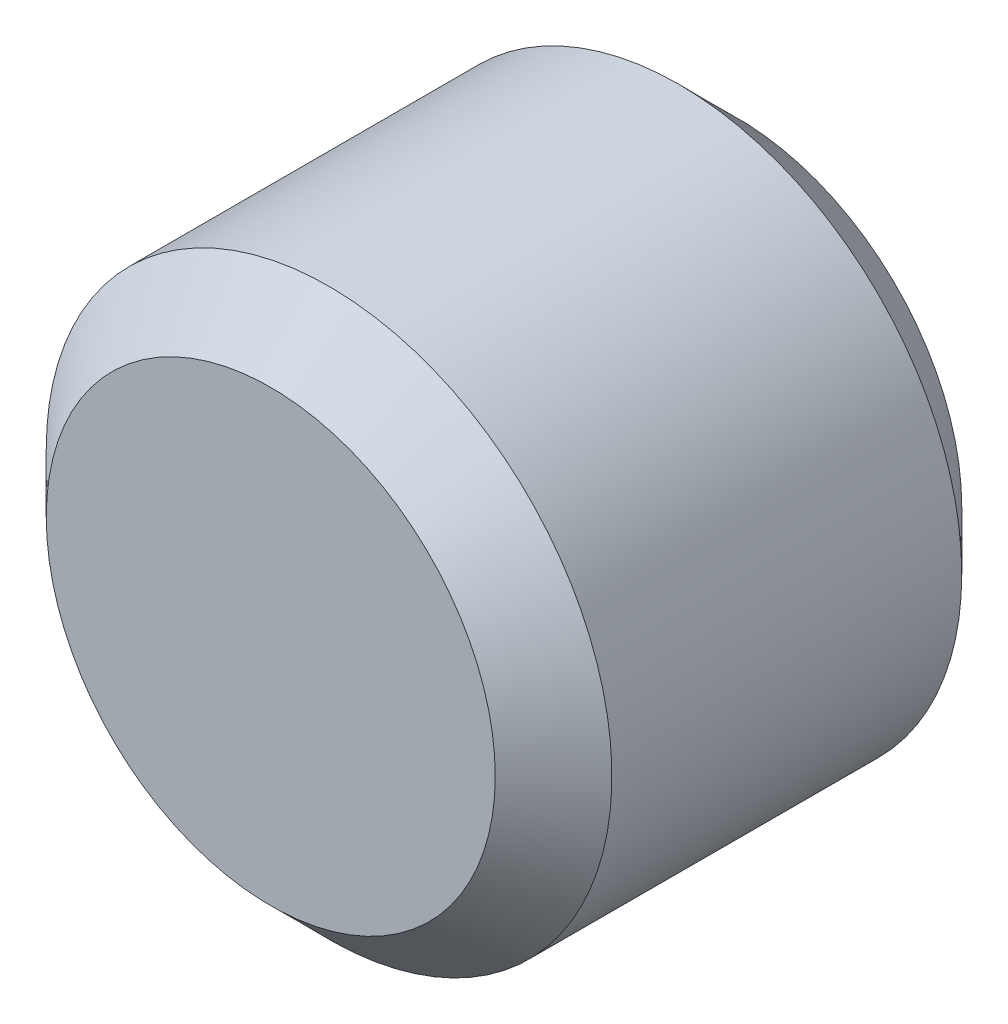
ISO-10303-21;
HEADER;
FILE_DESCRIPTION(('STEP AP214'),'2;1');
FILE_NAME('part.step','',(''),(''),'','','');
FILE_SCHEMA(('AUTOMOTIVE_DESIGN { 1 0 10303 214 1 1 1 1 }'));
ENDSEC;
DATA;
#1=APPLICATION_CONTEXT('core data for automotive mechanical design processes');
#2=APPLICATION_PROTOCOL_DEFINITION('international standard','automotive_design',2000,#1);
#3=PRODUCT_CONTEXT('',#1,'mechanical');
#4=PRODUCT('Part','Part','',(#3));
#5=PRODUCT_RELATED_PRODUCT_CATEGORY('part','',(#4));
#6=PRODUCT_DEFINITION_FORMATION('','',#4);
#7=PRODUCT_DEFINITION_CONTEXT('part definition',#1,'design');
#8=PRODUCT_DEFINITION('design','',#6,#7);
#9=PRODUCT_DEFINITION_SHAPE('','',#8);
#10=(LENGTH_UNIT() NAMED_UNIT(*) SI_UNIT(.MILLI.,.METRE.));
#11=(NAMED_UNIT(*) PLANE_ANGLE_UNIT() SI_UNIT($,.RADIAN.));
#12=(NAMED_UNIT(*) SI_UNIT($,.STERADIAN.) SOLID_ANGLE_UNIT());
#13=UNCERTAINTY_MEASURE_WITH_UNIT(LENGTH_MEASURE(1.E-05),#10,'distance_accuracy_value','');
#14=(GEOMETRIC_REPRESENTATION_CONTEXT(3) GLOBAL_UNCERTAINTY_ASSIGNED_CONTEXT((#13)) GLOBAL_UNIT_ASSIGNED_CONTEXT((#10,
#11,#12)) REPRESENTATION_CONTEXT('',''));
#15=CARTESIAN_POINT('',(0.,0.,0.));
#16=DIRECTION('',(0.,0.,1.));
#17=DIRECTION('',(1.,0.,0.));
#18=AXIS2_PLACEMENT_3D('',#15,#16,#17);
#19=CARTESIAN_POINT('',(0.,0.,7.99999999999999));
#20=DIRECTION('',(0.,0.,-1.));
#21=DIRECTION('',(-1.,0.,0.));
#22=AXIS2_PLACEMENT_3D('',#19,#20,#21);
#23=CYLINDRICAL_SURFACE('',#22,4.85);
#24=CARTESIAN_POINT('',(0.,0.,6.99999999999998));
#25=DIRECTION('',(0.,0.,1.));
#26=DIRECTION('',(1.,0.,0.));
#27=AXIS2_PLACEMENT_3D('',#24,#25,#26);
#28=CIRCLE('',#27,4.85);
#29=CARTESIAN_POINT('',(-4.84999999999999,0.,6.99999999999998));
#30=VERTEX_POINT('',#29);
#31=EDGE_CURVE('E37',#30,#30,#28,.F.);
#32=CARTESIAN_POINT('',(0.,0.,1.00000000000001));
#33=DIRECTION('',(0.,0.,1.));
#34=DIRECTION('',(1.,0.,0.));
#35=AXIS2_PLACEMENT_3D('',#32,#33,#34);
#36=CIRCLE('',#35,4.85);
#37=CARTESIAN_POINT('',(-4.84999999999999,0.,1.00000000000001));
#38=VERTEX_POINT('',#37);
#39=EDGE_CURVE('E141',#38,#38,#36,.T.);
#40=CARTESIAN_POINT('',(-4.84999999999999,0.,6.99999999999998));
#41=CARTESIAN_POINT('',(-4.84999999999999,0.,6.93749999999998));
#42=CARTESIAN_POINT('',(-4.84999999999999,0.,6.87499999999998));
#43=CARTESIAN_POINT('',(-4.84999999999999,0.,6.74999999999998));
#44=CARTESIAN_POINT('',(-4.84999999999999,0.,6.68749999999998));
#45=CARTESIAN_POINT('',(-4.84999999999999,0.,6.56249999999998));
#46=CARTESIAN_POINT('',(-4.84999999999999,0.,6.49999999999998));
#47=CARTESIAN_POINT('',(-4.84999999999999,0.,6.37499999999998));
#48=CARTESIAN_POINT('',(-4.84999999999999,0.,6.31249999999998));
#49=CARTESIAN_POINT('',(-4.84999999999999,0.,6.18749999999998));
#50=CARTESIAN_POINT('',(-4.84999999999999,0.,6.12499999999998));
#51=CARTESIAN_POINT('',(-4.84999999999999,0.,5.99999999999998));
#52=CARTESIAN_POINT('',(-4.84999999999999,0.,5.93749999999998));
#53=CARTESIAN_POINT('',(-4.84999999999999,0.,5.81249999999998));
#54=CARTESIAN_POINT('',(-4.84999999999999,0.,5.74999999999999));
#55=CARTESIAN_POINT('',(-4.84999999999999,0.,5.62499999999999));
#56=CARTESIAN_POINT('',(-4.84999999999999,0.,5.56249999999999));
#57=CARTESIAN_POINT('',(-4.84999999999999,0.,5.43749999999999));
#58=CARTESIAN_POINT('',(-4.84999999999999,0.,5.37499999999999));
#59=CARTESIAN_POINT('',(-4.84999999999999,0.,5.24999999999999));
#60=CARTESIAN_POINT('',(-4.84999999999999,0.,5.18749999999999));
#61=CARTESIAN_POINT('',(-4.84999999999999,0.,5.06249999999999));
#62=CARTESIAN_POINT('',(-4.84999999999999,0.,4.99999999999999));
#63=CARTESIAN_POINT('',(-4.84999999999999,0.,4.87499999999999));
#64=CARTESIAN_POINT('',(-4.84999999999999,0.,4.81249999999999));
#65=CARTESIAN_POINT('',(-4.84999999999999,0.,4.68749999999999));
#66=CARTESIAN_POINT('',(-4.84999999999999,0.,4.62499999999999));
#67=CARTESIAN_POINT('',(-4.84999999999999,0.,4.49999999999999));
#68=CARTESIAN_POINT('',(-4.84999999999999,0.,4.43749999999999));
#69=CARTESIAN_POINT('',(-4.84999999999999,0.,4.31249999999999));
#70=CARTESIAN_POINT('',(-4.84999999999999,0.,4.24999999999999));
#71=CARTESIAN_POINT('',(-4.84999999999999,0.,4.125));
#72=CARTESIAN_POINT('',(-4.84999999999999,0.,4.0625));
#73=CARTESIAN_POINT('',(-4.84999999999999,0.,3.9375));
#74=CARTESIAN_POINT('',(-4.84999999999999,0.,3.875));
#75=CARTESIAN_POINT('',(-4.84999999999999,0.,3.75));
#76=CARTESIAN_POINT('',(-4.84999999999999,0.,3.6875));
#77=CARTESIAN_POINT('',(-4.84999999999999,0.,3.5625));
#78=CARTESIAN_POINT('',(-4.84999999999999,0.,3.5));
#79=CARTESIAN_POINT('',(-4.84999999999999,0.,3.375));
#80=CARTESIAN_POINT('',(-4.84999999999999,0.,3.3125));
#81=CARTESIAN_POINT('',(-4.84999999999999,0.,3.1875));
#82=CARTESIAN_POINT('',(-4.84999999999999,0.,3.125));
#83=CARTESIAN_POINT('',(-4.84999999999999,0.,3.));
#84=CARTESIAN_POINT('',(-4.84999999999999,0.,2.9375));
#85=CARTESIAN_POINT('',(-4.84999999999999,0.,2.8125));
#86=CARTESIAN_POINT('',(-4.84999999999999,0.,2.75));
#87=CARTESIAN_POINT('',(-4.84999999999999,0.,2.62500000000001));
#88=CARTESIAN_POINT('',(-4.84999999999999,0.,2.56250000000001));
#89=CARTESIAN_POINT('',(-4.84999999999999,0.,2.43750000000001));
#90=CARTESIAN_POINT('',(-4.84999999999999,0.,2.37500000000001));
#91=CARTESIAN_POINT('',(-4.84999999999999,0.,2.25000000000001));
#92=CARTESIAN_POINT('',(-4.84999999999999,0.,2.18750000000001));
#93=CARTESIAN_POINT('',(-4.84999999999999,0.,2.06250000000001));
#94=CARTESIAN_POINT('',(-4.84999999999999,0.,2.00000000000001));
#95=CARTESIAN_POINT('',(-4.84999999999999,0.,1.87500000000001));
#96=CARTESIAN_POINT('',(-4.84999999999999,0.,1.81250000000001));
#97=CARTESIAN_POINT('',(-4.84999999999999,0.,1.68750000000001));
#98=CARTESIAN_POINT('',(-4.84999999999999,0.,1.62500000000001));
#99=CARTESIAN_POINT('',(-4.84999999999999,0.,1.50000000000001));
#100=CARTESIAN_POINT('',(-4.84999999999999,0.,1.43750000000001));
#101=CARTESIAN_POINT('',(-4.84999999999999,0.,1.31250000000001));
#102=CARTESIAN_POINT('',(-4.84999999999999,0.,1.25000000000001));
#103=CARTESIAN_POINT('',(-4.84999999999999,0.,1.12500000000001));
#104=CARTESIAN_POINT('',(-4.84999999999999,0.,1.06250000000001));
#105=CARTESIAN_POINT('',(-4.84999999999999,0.,1.00000000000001));
#106=B_SPLINE_CURVE_WITH_KNOTS('',3,(#40,#41,#42,#43,#44,#45,#46,#47,#48,#49,#50,#51,#52,#53,
#54,#55,#56,#57,#58,#59,#60,#61,#62,#63,#64,#65,#66,#67,#68,#69,#70,#71,#72,#73,#74,#75,#76,#77,
#78,#79,#80,#81,#82,#83,#84,#85,#86,#87,#88,#89,#90,#91,#92,#93,#94,#95,#96,#97,#98,#99,#100,
#101,#102,#103,#104,#105),.UNSPECIFIED.,.F.,.F.,(4,2,2,2,2,2,2,2,2,2,2,2,2,2,2,2,2,2,2,2,2,2,2,
2,2,2,2,2,2,2,2,2,4),(0.,0.187499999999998,0.374999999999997,0.562499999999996,
0.749999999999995,0.937499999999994,1.12499999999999,1.31249999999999,1.49999999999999,
1.68749999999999,1.87499999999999,2.06249999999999,2.24999999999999,2.43749999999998,
2.62499999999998,2.81249999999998,2.99999999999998,3.18749999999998,3.37499999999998,
3.56249999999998,3.74999999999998,3.93749999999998,4.12499999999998,4.31249999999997,
4.49999999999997,4.68749999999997,4.87499999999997,5.06249999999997,5.24999999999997,
5.43749999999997,5.62499999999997,5.81249999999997,5.99999999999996),.UNSPECIFIED.);
#107=EDGE_CURVE('BSEAM30',#30,#38,#106,.T.);
#108=ORIENTED_EDGE('',*,*,#31,.T.);
#109=ORIENTED_EDGE('',*,*,#39,.T.);
#110=ORIENTED_EDGE('',*,*,#107,.T.);
#111=ORIENTED_EDGE('',*,*,#107,.F.);
#112=EDGE_LOOP('',(#108,#110,#109,#111));
#113=FACE_BOUND('',#112,.T.);
#114=ADVANCED_FACE('F30',(#113),#23,.T.);
#115=CARTESIAN_POINT('',(0.,0.,7.99999999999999));
#116=DIRECTION('',(0.,0.,1.));
#117=DIRECTION('',(1.,0.,0.));
#118=AXIS2_PLACEMENT_3D('',#115,#116,#117);
#119=PLANE('',#118);
#120=CARTESIAN_POINT('',(0.,0.,7.99999999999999));
#121=DIRECTION('',(0.,0.,1.));
#122=DIRECTION('',(1.,0.,0.));
#123=AXIS2_PLACEMENT_3D('',#120,#121,#122);
#124=CIRCLE('',#123,3.84999999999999);
#125=CARTESIAN_POINT('',(-3.84999999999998,0.,7.99999999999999));
#126=VERTEX_POINT('',#125);
#127=EDGE_CURVE('E132',#126,#126,#124,.T.);
#128=ORIENTED_EDGE('',*,*,#127,.T.);
#129=EDGE_LOOP('',(#128));
#130=FACE_BOUND('',#129,.T.);
#131=ADVANCED_FACE('F155',(#130),#119,.T.);
#132=CARTESIAN_POINT('',(0.,0.,0.));
#133=DIRECTION('',(0.,0.,1.));
#134=DIRECTION('',(1.,0.,0.));
#135=AXIS2_PLACEMENT_3D('',#132,#133,#134);
#136=PLANE('',#135);
#137=DIRECTION('',(0.5,0.866025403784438,0.));
#138=VECTOR('',#137,1.);
#139=CARTESIAN_POINT('',(-2.8867513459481,0.,0.));
#140=LINE('',#139,#138);
#141=CARTESIAN_POINT('',(-2.8867513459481,0.,0.));
#142=VERTEX_POINT('',#141);
#143=CARTESIAN_POINT('',(-1.44337567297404,2.49999999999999,0.));
#144=VERTEX_POINT('',#143);
#145=EDGE_CURVE('E98',#142,#144,#140,.T.);
#146=ORIENTED_EDGE('',*,*,#145,.F.);
#147=DIRECTION('',(-0.499999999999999,0.866025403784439,0.));
#148=VECTOR('',#147,1.);
#149=CARTESIAN_POINT('',(-1.44337567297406,-2.5,0.));
#150=LINE('',#149,#148);
#151=CARTESIAN_POINT('',(-1.44337567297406,-2.5,0.));
#152=VERTEX_POINT('',#151);
#153=EDGE_CURVE('E44',#152,#142,#150,.T.);
#154=ORIENTED_EDGE('',*,*,#153,.F.);
#155=DIRECTION('',(-1.,0.,0.));
#156=VECTOR('',#155,1.);
#157=CARTESIAN_POINT('',(1.44337567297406,-2.5,0.));
#158=LINE('',#157,#156);
#159=CARTESIAN_POINT('',(1.44337567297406,-2.5,0.));
#160=VERTEX_POINT('',#159);
#161=EDGE_CURVE('E114',#160,#152,#158,.T.);
#162=ORIENTED_EDGE('',*,*,#161,.F.);
#163=DIRECTION('',(-0.5,-0.866025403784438,0.));
#164=VECTOR('',#163,1.);
#165=CARTESIAN_POINT('',(2.88675134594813,0.,0.));
#166=LINE('',#165,#164);
#167=CARTESIAN_POINT('',(2.88675134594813,0.,0.));
#168=VERTEX_POINT('',#167);
#169=EDGE_CURVE('E108',#168,#160,#166,.T.);
#170=ORIENTED_EDGE('',*,*,#169,.F.);
#171=DIRECTION('',(0.5,-0.866025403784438,0.));
#172=VECTOR('',#171,1.);
#173=CARTESIAN_POINT('',(1.44337567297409,2.49999999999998,0.));
#174=LINE('',#173,#172);
#175=CARTESIAN_POINT('',(1.44337567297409,2.49999999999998,0.));
#176=VERTEX_POINT('',#175);
#177=EDGE_CURVE('E106',#176,#168,#174,.T.);
#178=ORIENTED_EDGE('',*,*,#177,.F.);
#179=DIRECTION('',(1.,0.,0.));
#180=VECTOR('',#179,1.);
#181=CARTESIAN_POINT('',(-1.44337567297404,2.49999999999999,0.));
#182=LINE('',#181,#180);
#183=EDGE_CURVE('E87',#144,#176,#182,.T.);
#184=ORIENTED_EDGE('',*,*,#183,.F.);
#185=EDGE_LOOP('',(#146,#154,#162,#170,#178,#184));
#186=FACE_BOUND('',#185,.T.);
#187=CARTESIAN_POINT('',(0.,0.,0.));
#188=DIRECTION('',(0.,0.,1.));
#189=DIRECTION('',(1.,0.,0.));
#190=AXIS2_PLACEMENT_3D('',#187,#188,#189);
#191=CIRCLE('',#190,3.84999999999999);
#192=CARTESIAN_POINT('',(3.85,0.,0.));
#193=VERTEX_POINT('',#192);
#194=EDGE_CURVE('E11',#193,#193,#191,.F.);
#195=ORIENTED_EDGE('',*,*,#194,.T.);
#196=EDGE_LOOP('',(#195));
#197=FACE_BOUND('',#196,.T.);
#198=ADVANCED_FACE('F102',(#186,#197),#136,.F.);
#199=CARTESIAN_POINT('',(0.,0.,7.99999999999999));
#200=DIRECTION('',(0.,0.,-1.));
#201=DIRECTION('',(-1.,0.,0.));
#202=AXIS2_PLACEMENT_3D('',#199,#200,#201);
#203=CONICAL_SURFACE('',#202,3.84999999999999,0.785398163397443);
#204=CARTESIAN_POINT('',(-4.84999999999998,0.,6.99999999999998));
#205=CARTESIAN_POINT('',(-4.83958333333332,0.,7.01041666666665));
#206=CARTESIAN_POINT('',(-4.82916666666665,0.,7.02083333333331));
#207=CARTESIAN_POINT('',(-4.80833333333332,0.,7.04166666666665));
#208=CARTESIAN_POINT('',(-4.79791666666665,0.,7.05208333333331));
#209=CARTESIAN_POINT('',(-4.77708333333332,0.,7.07291666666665));
#210=CARTESIAN_POINT('',(-4.76666666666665,0.,7.08333333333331));
#211=CARTESIAN_POINT('',(-4.74583333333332,0.,7.10416666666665));
#212=CARTESIAN_POINT('',(-4.73541666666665,0.,7.11458333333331));
#213=CARTESIAN_POINT('',(-4.71458333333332,0.,7.13541666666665));
#214=CARTESIAN_POINT('',(-4.70416666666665,0.,7.14583333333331));
#215=CARTESIAN_POINT('',(-4.68333333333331,0.,7.16666666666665));
#216=CARTESIAN_POINT('',(-4.67291666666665,0.,7.17708333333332));
#217=CARTESIAN_POINT('',(-4.65208333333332,0.,7.19791666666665));
#218=CARTESIAN_POINT('',(-4.64166666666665,0.,7.20833333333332));
#219=CARTESIAN_POINT('',(-4.62083333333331,0.,7.22916666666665));
#220=CARTESIAN_POINT('',(-4.61041666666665,0.,7.23958333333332));
#221=CARTESIAN_POINT('',(-4.58958333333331,0.,7.26041666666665));
#222=CARTESIAN_POINT('',(-4.57916666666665,0.,7.27083333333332));
#223=CARTESIAN_POINT('',(-4.55833333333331,0.,7.29166666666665));
#224=CARTESIAN_POINT('',(-4.54791666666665,0.,7.30208333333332));
#225=CARTESIAN_POINT('',(-4.52708333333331,0.,7.32291666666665));
#226=CARTESIAN_POINT('',(-4.51666666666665,0.,7.33333333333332));
#227=CARTESIAN_POINT('',(-4.49583333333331,0.,7.35416666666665));
#228=CARTESIAN_POINT('',(-4.48541666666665,0.,7.36458333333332));
#229=CARTESIAN_POINT('',(-4.46458333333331,0.,7.38541666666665));
#230=CARTESIAN_POINT('',(-4.45416666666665,0.,7.39583333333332));
#231=CARTESIAN_POINT('',(-4.43333333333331,0.,7.41666666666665));
#232=CARTESIAN_POINT('',(-4.42291666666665,0.,7.42708333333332));
#233=CARTESIAN_POINT('',(-4.40208333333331,0.,7.44791666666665));
#234=CARTESIAN_POINT('',(-4.39166666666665,0.,7.45833333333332));
#235=CARTESIAN_POINT('',(-4.37083333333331,0.,7.47916666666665));
#236=CARTESIAN_POINT('',(-4.36041666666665,0.,7.48958333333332));
#237=CARTESIAN_POINT('',(-4.33958333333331,0.,7.51041666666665));
#238=CARTESIAN_POINT('',(-4.32916666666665,0.,7.52083333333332));
#239=CARTESIAN_POINT('',(-4.30833333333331,0.,7.54166666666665));
#240=CARTESIAN_POINT('',(-4.29791666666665,0.,7.55208333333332));
#241=CARTESIAN_POINT('',(-4.27708333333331,0.,7.57291666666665));
#242=CARTESIAN_POINT('',(-4.26666666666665,0.,7.58333333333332));
#243=CARTESIAN_POINT('',(-4.24583333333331,0.,7.60416666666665));
#244=CARTESIAN_POINT('',(-4.23541666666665,0.,7.61458333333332));
#245=CARTESIAN_POINT('',(-4.21458333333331,0.,7.63541666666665));
#246=CARTESIAN_POINT('',(-4.20416666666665,0.,7.64583333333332));
#247=CARTESIAN_POINT('',(-4.18333333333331,0.,7.66666666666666));
#248=CARTESIAN_POINT('',(-4.17291666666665,0.,7.67708333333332));
#249=CARTESIAN_POINT('',(-4.15208333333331,0.,7.69791666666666));
#250=CARTESIAN_POINT('',(-4.14166666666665,0.,7.70833333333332));
#251=CARTESIAN_POINT('',(-4.12083333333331,0.,7.72916666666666));
#252=CARTESIAN_POINT('',(-4.11041666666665,0.,7.73958333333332));
#253=CARTESIAN_POINT('',(-4.08958333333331,0.,7.76041666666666));
#254=CARTESIAN_POINT('',(-4.07916666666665,0.,7.77083333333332));
#255=CARTESIAN_POINT('',(-4.05833333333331,0.,7.79166666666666));
#256=CARTESIAN_POINT('',(-4.04791666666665,0.,7.80208333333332));
#257=CARTESIAN_POINT('',(-4.02708333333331,0.,7.82291666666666));
#258=CARTESIAN_POINT('',(-4.01666666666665,0.,7.83333333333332));
#259=CARTESIAN_POINT('',(-3.99583333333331,0.,7.85416666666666));
#260=CARTESIAN_POINT('',(-3.98541666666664,0.,7.86458333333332));
#261=CARTESIAN_POINT('',(-3.96458333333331,0.,7.88541666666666));
#262=CARTESIAN_POINT('',(-3.95416666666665,0.,7.89583333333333));
#263=CARTESIAN_POINT('',(-3.93333333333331,0.,7.91666666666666));
#264=CARTESIAN_POINT('',(-3.92291666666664,0.,7.92708333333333));
#265=CARTESIAN_POINT('',(-3.90208333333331,0.,7.94791666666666));
#266=CARTESIAN_POINT('',(-3.89166666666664,0.,7.95833333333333));
#267=CARTESIAN_POINT('',(-3.87083333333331,0.,7.97916666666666));
#268=CARTESIAN_POINT('',(-3.86041666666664,0.,7.98958333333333));
#269=CARTESIAN_POINT('',(-3.84999999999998,0.,7.99999999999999));
#270=B_SPLINE_CURVE_WITH_KNOTS('',3,(#204,#205,#206,#207,#208,#209,#210,#211,#212,#213,#214,
#215,#216,#217,#218,#219,#220,#221,#222,#223,#224,#225,#226,#227,#228,#229,#230,#231,#232,#233,
#234,#235,#236,#237,#238,#239,#240,#241,#242,#243,#244,#245,#246,#247,#248,#249,#250,#251,#252,
#253,#254,#255,#256,#257,#258,#259,#260,#261,#262,#263,#264,#265,#266,#267,#268,#269),
.UNSPECIFIED.,.F.,.F.,(4,2,2,2,2,2,2,2,2,2,2,2,2,2,2,2,2,2,2,2,2,2,2,2,2,2,2,2,2,2,2,2,4),(0.,
0.0441941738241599,0.0883883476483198,0.132582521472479,0.176776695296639,0.220970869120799,
0.265165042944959,0.309359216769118,0.353553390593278,0.397747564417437,0.441941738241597,
0.486135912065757,0.530330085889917,0.574524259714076,0.618718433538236,0.662912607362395,
0.707106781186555,0.751300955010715,0.795495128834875,0.839689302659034,0.883883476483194,
0.928077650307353,0.972271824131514,1.01646599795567,1.06066017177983,1.10485434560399,
1.14904851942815,1.19324269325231,1.23743686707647,1.28163104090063,1.32582521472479,
1.37001938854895,1.41421356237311),.UNSPECIFIED.);
#271=EDGE_CURVE('BSEAM148',#30,#126,#270,.T.);
#272=ORIENTED_EDGE('',*,*,#31,.F.);
#273=ORIENTED_EDGE('',*,*,#127,.F.);
#274=ORIENTED_EDGE('',*,*,#271,.T.);
#275=ORIENTED_EDGE('',*,*,#271,.F.);
#276=EDGE_LOOP('',(#272,#274,#273,#275));
#277=FACE_BOUND('',#276,.T.);
#278=ADVANCED_FACE('F148',(#277),#203,.T.);
#279=CARTESIAN_POINT('',(0.,0.,1.00000000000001));
#280=DIRECTION('',(0.,0.,1.));
#281=DIRECTION('',(1.,0.,0.));
#282=AXIS2_PLACEMENT_3D('',#279,#280,#281);
#283=CONICAL_SURFACE('',#282,4.85,0.785398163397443);
#284=ORIENTED_EDGE('',*,*,#194,.F.);
#285=EDGE_LOOP('',(#284));
#286=FACE_BOUND('',#285,.T.);
#287=ORIENTED_EDGE('',*,*,#39,.F.);
#288=EDGE_LOOP('',(#287));
#289=FACE_BOUND('',#288,.T.);
#290=ADVANCED_FACE('F151',(#286,#289),#283,.T.);
#291=CARTESIAN_POINT('',(-1.44337567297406,-2.50000000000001,5.));
#292=DIRECTION('',(-0.866025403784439,-0.499999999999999,0.));
#293=DIRECTION('',(0.499999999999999,-0.866025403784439,0.));
#294=AXIS2_PLACEMENT_3D('',#291,#292,#293);
#295=PLANE('',#294);
#296=ORIENTED_EDGE('',*,*,#153,.T.);
#297=DIRECTION('',(0.,0.,-1.));
#298=VECTOR('',#297,1.);
#299=CARTESIAN_POINT('',(-2.8867513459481,0.,5.));
#300=LINE('',#299,#298);
#301=CARTESIAN_POINT('',(-2.8867513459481,0.,5.));
#302=VERTEX_POINT('',#301);
#303=EDGE_CURVE('E95',#302,#142,#300,.T.);
#304=ORIENTED_EDGE('',*,*,#303,.F.);
#305=DIRECTION('',(-0.499999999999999,0.866025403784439,0.));
#306=VECTOR('',#305,1.);
#307=CARTESIAN_POINT('',(-1.44337567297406,-2.50000000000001,5.));
#308=LINE('',#307,#306);
#309=CARTESIAN_POINT('',(-1.44337567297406,-2.50000000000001,5.));
#310=VERTEX_POINT('',#309);
#311=EDGE_CURVE('E116',#310,#302,#308,.T.);
#312=ORIENTED_EDGE('',*,*,#311,.F.);
#313=DIRECTION('',(0.,0.,-1.));
#314=VECTOR('',#313,1.);
#315=CARTESIAN_POINT('',(-1.44337567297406,-2.50000000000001,5.));
#316=LINE('',#315,#314);
#317=EDGE_CURVE('E51',#310,#152,#316,.T.);
#318=ORIENTED_EDGE('',*,*,#317,.T.);
#319=EDGE_LOOP('',(#296,#304,#312,#318));
#320=FACE_BOUND('',#319,.T.);
#321=ADVANCED_FACE('F165',(#320),#295,.F.);
#322=CARTESIAN_POINT('',(1.44337567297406,-2.5,5.));
#323=DIRECTION('',(0.,-1.,0.));
#324=DIRECTION('',(0.,0.,-1.));
#325=AXIS2_PLACEMENT_3D('',#322,#323,#324);
#326=PLANE('',#325);
#327=ORIENTED_EDGE('',*,*,#161,.T.);
#328=ORIENTED_EDGE('',*,*,#317,.F.);
#329=DIRECTION('',(-1.,0.,0.));
#330=VECTOR('',#329,1.);
#331=CARTESIAN_POINT('',(1.44337567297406,-2.5,5.));
#332=LINE('',#331,#330);
#333=CARTESIAN_POINT('',(1.44337567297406,-2.5,5.));
#334=VERTEX_POINT('',#333);
#335=EDGE_CURVE('E128',#334,#310,#332,.T.);
#336=ORIENTED_EDGE('',*,*,#335,.F.);
#337=DIRECTION('',(0.,0.,-1.));
#338=VECTOR('',#337,1.);
#339=CARTESIAN_POINT('',(1.44337567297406,-2.5,5.));
#340=LINE('',#339,#338);
#341=EDGE_CURVE('E133',#334,#160,#340,.T.);
#342=ORIENTED_EDGE('',*,*,#341,.T.);
#343=EDGE_LOOP('',(#327,#328,#336,#342));
#344=FACE_BOUND('',#343,.T.);
#345=ADVANCED_FACE('F169',(#344),#326,.F.);
#346=CARTESIAN_POINT('',(2.88675134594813,0.,5.));
#347=DIRECTION('',(0.866025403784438,-0.5,0.));
#348=DIRECTION('',(0.5,0.866025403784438,0.));
#349=AXIS2_PLACEMENT_3D('',#346,#347,#348);
#350=PLANE('',#349);
#351=ORIENTED_EDGE('',*,*,#169,.T.);
#352=ORIENTED_EDGE('',*,*,#341,.F.);
#353=DIRECTION('',(-0.5,-0.866025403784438,0.));
#354=VECTOR('',#353,1.);
#355=CARTESIAN_POINT('',(2.88675134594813,0.,5.));
#356=LINE('',#355,#354);
#357=CARTESIAN_POINT('',(2.88675134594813,0.,5.));
#358=VERTEX_POINT('',#357);
#359=EDGE_CURVE('E125',#358,#334,#356,.T.);
#360=ORIENTED_EDGE('',*,*,#359,.F.);
#361=DIRECTION('',(0.,0.,-1.));
#362=VECTOR('',#361,1.);
#363=CARTESIAN_POINT('',(2.88675134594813,0.,5.));
#364=LINE('',#363,#362);
#365=EDGE_CURVE('E135',#358,#168,#364,.T.);
#366=ORIENTED_EDGE('',*,*,#365,.T.);
#367=EDGE_LOOP('',(#351,#352,#360,#366));
#368=FACE_BOUND('',#367,.T.);
#369=ADVANCED_FACE('F178',(#368),#350,.F.);
#370=CARTESIAN_POINT('',(1.44337567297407,2.49999999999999,5.));
#371=DIRECTION('',(0.866025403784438,0.5,0.));
#372=DIRECTION('',(-0.5,0.866025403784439,0.));
#373=AXIS2_PLACEMENT_3D('',#370,#371,#372);
#374=PLANE('',#373);
#375=ORIENTED_EDGE('',*,*,#177,.T.);
#376=ORIENTED_EDGE('',*,*,#365,.F.);
#377=DIRECTION('',(0.5,-0.866025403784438,0.));
#378=VECTOR('',#377,1.);
#379=CARTESIAN_POINT('',(1.44337567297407,2.49999999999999,5.));
#380=LINE('',#379,#378);
#381=CARTESIAN_POINT('',(1.44337567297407,2.49999999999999,5.));
#382=VERTEX_POINT('',#381);
#383=EDGE_CURVE('E122',#382,#358,#380,.T.);
#384=ORIENTED_EDGE('',*,*,#383,.F.);
#385=DIRECTION('',(0.,0.,-1.));
#386=VECTOR('',#385,1.);
#387=CARTESIAN_POINT('',(1.44337567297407,2.49999999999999,5.));
#388=LINE('',#387,#386);
#389=EDGE_CURVE('E94',#382,#176,#388,.T.);
#390=ORIENTED_EDGE('',*,*,#389,.T.);
#391=EDGE_LOOP('',(#375,#376,#384,#390));
#392=FACE_BOUND('',#391,.T.);
#393=ADVANCED_FACE('F175',(#392),#374,.F.);
#394=CARTESIAN_POINT('',(-1.44337567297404,2.49999999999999,5.));
#395=DIRECTION('',(0.,1.,0.));
#396=DIRECTION('',(-1.,0.,0.));
#397=AXIS2_PLACEMENT_3D('',#394,#395,#396);
#398=PLANE('',#397);
#399=ORIENTED_EDGE('',*,*,#183,.T.);
#400=ORIENTED_EDGE('',*,*,#389,.F.);
#401=DIRECTION('',(1.,0.,0.));
#402=VECTOR('',#401,1.);
#403=CARTESIAN_POINT('',(-1.44337567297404,2.49999999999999,5.));
#404=LINE('',#403,#402);
#405=CARTESIAN_POINT('',(-1.44337567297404,2.49999999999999,5.));
#406=VERTEX_POINT('',#405);
#407=EDGE_CURVE('E90',#406,#382,#404,.T.);
#408=ORIENTED_EDGE('',*,*,#407,.F.);
#409=DIRECTION('',(0.,0.,-1.));
#410=VECTOR('',#409,1.);
#411=CARTESIAN_POINT('',(-1.44337567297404,2.49999999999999,5.));
#412=LINE('',#411,#410);
#413=EDGE_CURVE('E83',#406,#144,#412,.T.);
#414=ORIENTED_EDGE('',*,*,#413,.T.);
#415=EDGE_LOOP('',(#399,#400,#408,#414));
#416=FACE_BOUND('',#415,.T.);
#417=ADVANCED_FACE('F85',(#416),#398,.F.);
#418=CARTESIAN_POINT('',(-2.8867513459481,0.,5.));
#419=DIRECTION('',(-0.866025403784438,0.5,0.));
#420=DIRECTION('',(-0.5,-0.866025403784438,0.));
#421=AXIS2_PLACEMENT_3D('',#418,#419,#420);
#422=PLANE('',#421);
#423=ORIENTED_EDGE('',*,*,#145,.T.);
#424=ORIENTED_EDGE('',*,*,#413,.F.);
#425=DIRECTION('',(0.5,0.866025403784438,0.));
#426=VECTOR('',#425,1.);
#427=CARTESIAN_POINT('',(-2.8867513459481,0.,5.));
#428=LINE('',#427,#426);
#429=EDGE_CURVE('E119',#302,#406,#428,.T.);
#430=ORIENTED_EDGE('',*,*,#429,.F.);
#431=ORIENTED_EDGE('',*,*,#303,.T.);
#432=EDGE_LOOP('',(#423,#424,#430,#431));
#433=FACE_BOUND('',#432,.T.);
#434=ADVANCED_FACE('F99',(#433),#422,.F.);
#435=CARTESIAN_POINT('',(-1.44337567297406,-2.50000000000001,5.));
#436=DIRECTION('',(0.,0.,1.));
#437=DIRECTION('',(1.,0.,0.));
#438=AXIS2_PLACEMENT_3D('',#435,#436,#437);
#439=PLANE('',#438);
#440=ORIENTED_EDGE('',*,*,#311,.T.);
#441=ORIENTED_EDGE('',*,*,#429,.T.);
#442=ORIENTED_EDGE('',*,*,#407,.T.);
#443=ORIENTED_EDGE('',*,*,#383,.T.);
#444=ORIENTED_EDGE('',*,*,#359,.T.);
#445=ORIENTED_EDGE('',*,*,#335,.T.);
#446=EDGE_LOOP('',(#440,#441,#442,#443,#444,#445));
#447=FACE_BOUND('',#446,.T.);
#448=ADVANCED_FACE('F172',(#447),#439,.F.);
#449=CLOSED_SHELL('',(#114,#131,#198,#278,#290,#321,#345,#369,#393,#417,#434,#448));
#450=MANIFOLD_SOLID_BREP('B2',#449);
#451=ADVANCED_BREP_SHAPE_REPRESENTATION('',(#18,#450),#14);
#452=SHAPE_DEFINITION_REPRESENTATION(#9,#451);
ENDSEC;
END-ISO-10303-21;
